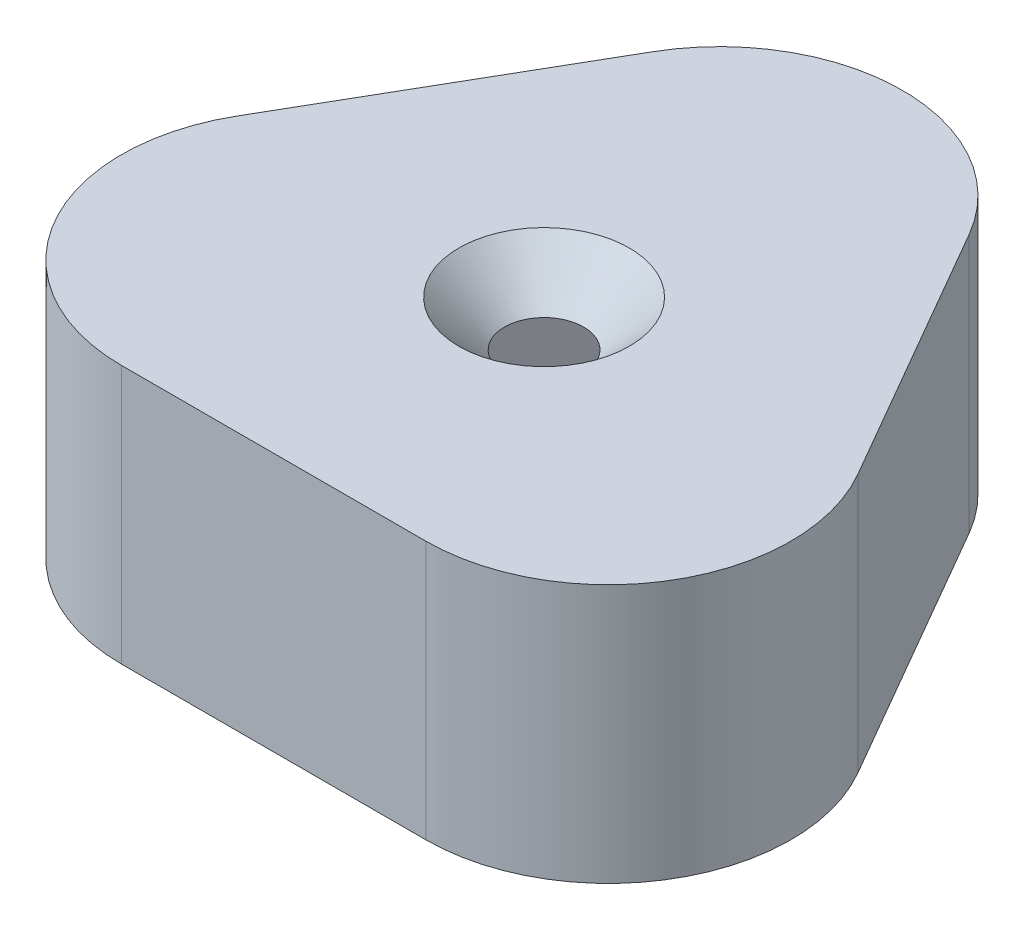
ISO-10303-21;
HEADER;
FILE_DESCRIPTION(('STEP AP214'),'2;1');
FILE_NAME('part.step','',(''),(''),'','','');
FILE_SCHEMA(('AUTOMOTIVE_DESIGN { 1 0 10303 214 1 1 1 1 }'));
ENDSEC;
DATA;
#1=APPLICATION_CONTEXT('core data for automotive mechanical design processes');
#2=APPLICATION_PROTOCOL_DEFINITION('international standard','automotive_design',2000,#1);
#3=PRODUCT_CONTEXT('',#1,'mechanical');
#4=PRODUCT('Part','Part','',(#3));
#5=PRODUCT_RELATED_PRODUCT_CATEGORY('part','',(#4));
#6=PRODUCT_DEFINITION_FORMATION('','',#4);
#7=PRODUCT_DEFINITION_CONTEXT('part definition',#1,'design');
#8=PRODUCT_DEFINITION('design','',#6,#7);
#9=PRODUCT_DEFINITION_SHAPE('','',#8);
#10=(LENGTH_UNIT() NAMED_UNIT(*) SI_UNIT(.MILLI.,.METRE.));
#11=(NAMED_UNIT(*) PLANE_ANGLE_UNIT() SI_UNIT($,.RADIAN.));
#12=(NAMED_UNIT(*) SI_UNIT($,.STERADIAN.) SOLID_ANGLE_UNIT());
#13=UNCERTAINTY_MEASURE_WITH_UNIT(LENGTH_MEASURE(1.E-05),#10,'distance_accuracy_value','');
#14=(GEOMETRIC_REPRESENTATION_CONTEXT(3) GLOBAL_UNCERTAINTY_ASSIGNED_CONTEXT((#13)) GLOBAL_UNIT_ASSIGNED_CONTEXT((#10,
#11,#12)) REPRESENTATION_CONTEXT('',''));
#15=CARTESIAN_POINT('',(0.,0.,0.));
#16=DIRECTION('',(0.,0.,1.));
#17=DIRECTION('',(1.,0.,0.));
#18=AXIS2_PLACEMENT_3D('',#15,#16,#17);
#19=CARTESIAN_POINT('',(0.,17.,-11.5470053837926));
#20=DIRECTION('',(0.,-1.,0.));
#21=DIRECTION('',(0.,0.,-1.));
#22=AXIS2_PLACEMENT_3D('',#19,#20,#21);
#23=CYLINDRICAL_SURFACE('',#22,12.);
#24=CARTESIAN_POINT('',(0.,0.,-11.5470053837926));
#25=DIRECTION('',(0.,1.,0.));
#26=DIRECTION('',(0.,0.,-1.));
#27=AXIS2_PLACEMENT_3D('',#24,#25,#26);
#28=CIRCLE('',#27,12.);
#29=CARTESIAN_POINT('',(10.3923048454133,0.,-17.5470053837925));
#30=VERTEX_POINT('',#29);
#31=CARTESIAN_POINT('',(-10.3923048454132,0.,-17.5470053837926));
#32=VERTEX_POINT('',#31);
#33=EDGE_CURVE('E255',#30,#32,#28,.T.);
#34=ORIENTED_EDGE('',*,*,#33,.T.);
#35=DIRECTION('',(0.,-1.,0.));
#36=VECTOR('',#35,1.);
#37=CARTESIAN_POINT('',(-10.3923048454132,17.,-17.5470053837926));
#38=LINE('',#37,#36);
#39=CARTESIAN_POINT('',(-10.3923048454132,17.,-17.5470053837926));
#40=VERTEX_POINT('',#39);
#41=EDGE_CURVE('E296',#40,#32,#38,.T.);
#42=ORIENTED_EDGE('',*,*,#41,.F.);
#43=CARTESIAN_POINT('',(0.,17.,-11.5470053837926));
#44=DIRECTION('',(0.,1.,0.));
#45=DIRECTION('',(0.,0.,-1.));
#46=AXIS2_PLACEMENT_3D('',#43,#44,#45);
#47=CIRCLE('',#46,12.);
#48=CARTESIAN_POINT('',(10.3923048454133,17.,-17.5470053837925));
#49=VERTEX_POINT('',#48);
#50=EDGE_CURVE('E256',#49,#40,#47,.T.);
#51=ORIENTED_EDGE('',*,*,#50,.F.);
#52=DIRECTION('',(0.,-1.,0.));
#53=VECTOR('',#52,1.);
#54=CARTESIAN_POINT('',(10.3923048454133,17.,-17.5470053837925));
#55=LINE('',#54,#53);
#56=EDGE_CURVE('E270',#49,#30,#55,.T.);
#57=ORIENTED_EDGE('',*,*,#56,.T.);
#58=EDGE_LOOP('',(#34,#42,#51,#57));
#59=FACE_BOUND('',#58,.T.);
#60=ADVANCED_FACE('F37',(#59),#23,.T.);
#61=CARTESIAN_POINT('',(-10.3923048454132,17.,-17.5470053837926));
#62=DIRECTION('',(0.866025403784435,0.,0.500000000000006));
#63=DIRECTION('',(0.500000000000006,0.,-0.866025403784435));
#64=AXIS2_PLACEMENT_3D('',#61,#62,#63);
#65=PLANE('',#64);
#66=DIRECTION('',(-0.500000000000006,0.,0.866025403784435));
#67=VECTOR('',#66,1.);
#68=CARTESIAN_POINT('',(-10.3923048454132,0.,-17.5470053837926));
#69=LINE('',#68,#67);
#70=CARTESIAN_POINT('',(-20.3923048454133,0.,-0.226497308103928));
#71=VERTEX_POINT('',#70);
#72=EDGE_CURVE('E273',#32,#71,#69,.T.);
#73=ORIENTED_EDGE('',*,*,#72,.T.);
#74=DIRECTION('',(0.,-1.,0.));
#75=VECTOR('',#74,1.);
#76=CARTESIAN_POINT('',(-20.3923048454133,17.,-0.226497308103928));
#77=LINE('',#76,#75);
#78=CARTESIAN_POINT('',(-20.3923048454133,17.,-0.226497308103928));
#79=VERTEX_POINT('',#78);
#80=EDGE_CURVE('E293',#79,#71,#77,.T.);
#81=ORIENTED_EDGE('',*,*,#80,.F.);
#82=DIRECTION('',(-0.500000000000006,0.,0.866025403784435));
#83=VECTOR('',#82,1.);
#84=CARTESIAN_POINT('',(-10.3923048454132,17.,-17.5470053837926));
#85=LINE('',#84,#83);
#86=EDGE_CURVE('E259',#40,#79,#85,.T.);
#87=ORIENTED_EDGE('',*,*,#86,.F.);
#88=ORIENTED_EDGE('',*,*,#41,.T.);
#89=EDGE_LOOP('',(#73,#81,#87,#88));
#90=FACE_BOUND('',#89,.T.);
#91=ADVANCED_FACE('F317',(#90),#65,.F.);
#92=CARTESIAN_POINT('',(-10.0000000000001,17.,5.77350269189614));
#93=DIRECTION('',(0.,-1.,0.));
#94=DIRECTION('',(0.,0.,-1.));
#95=AXIS2_PLACEMENT_3D('',#92,#93,#94);
#96=CYLINDRICAL_SURFACE('',#95,12.);
#97=CARTESIAN_POINT('',(-10.0000000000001,0.,5.77350269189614));
#98=DIRECTION('',(0.,1.,0.));
#99=DIRECTION('',(0.,0.,1.));
#100=AXIS2_PLACEMENT_3D('',#97,#98,#99);
#101=CIRCLE('',#100,12.);
#102=CARTESIAN_POINT('',(-10.0000000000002,0.,17.7735026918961));
#103=VERTEX_POINT('',#102);
#104=EDGE_CURVE('E275',#71,#103,#101,.T.);
#105=ORIENTED_EDGE('',*,*,#104,.T.);
#106=DIRECTION('',(0.,-1.,0.));
#107=VECTOR('',#106,1.);
#108=CARTESIAN_POINT('',(-10.0000000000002,17.,17.7735026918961));
#109=LINE('',#108,#107);
#110=CARTESIAN_POINT('',(-10.0000000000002,17.,17.7735026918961));
#111=VERTEX_POINT('',#110);
#112=EDGE_CURVE('E290',#111,#103,#109,.T.);
#113=ORIENTED_EDGE('',*,*,#112,.F.);
#114=CARTESIAN_POINT('',(-10.0000000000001,17.,5.77350269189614));
#115=DIRECTION('',(0.,1.,0.));
#116=DIRECTION('',(0.,0.,1.));
#117=AXIS2_PLACEMENT_3D('',#114,#115,#116);
#118=CIRCLE('',#117,12.);
#119=EDGE_CURVE('E262',#79,#111,#118,.T.);
#120=ORIENTED_EDGE('',*,*,#119,.F.);
#121=ORIENTED_EDGE('',*,*,#80,.T.);
#122=EDGE_LOOP('',(#105,#113,#120,#121));
#123=FACE_BOUND('',#122,.T.);
#124=ADVANCED_FACE('F322',(#123),#96,.T.);
#125=CARTESIAN_POINT('',(9.9999999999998,17.,17.7735026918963));
#126=DIRECTION('',(0.,0.,-1.));
#127=DIRECTION('',(-1.,0.,0.));
#128=AXIS2_PLACEMENT_3D('',#125,#126,#127);
#129=PLANE('',#128);
#130=DIRECTION('',(1.,0.,0.));
#131=VECTOR('',#130,1.);
#132=CARTESIAN_POINT('',(9.9999999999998,0.,17.7735026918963));
#133=LINE('',#132,#131);
#134=CARTESIAN_POINT('',(9.9999999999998,0.,17.7735026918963));
#135=VERTEX_POINT('',#134);
#136=EDGE_CURVE('E277',#103,#135,#133,.T.);
#137=ORIENTED_EDGE('',*,*,#136,.T.);
#138=DIRECTION('',(0.,-1.,0.));
#139=VECTOR('',#138,1.);
#140=CARTESIAN_POINT('',(9.9999999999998,17.,17.7735026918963));
#141=LINE('',#140,#139);
#142=CARTESIAN_POINT('',(9.9999999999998,17.,17.7735026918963));
#143=VERTEX_POINT('',#142);
#144=EDGE_CURVE('E287',#143,#135,#141,.T.);
#145=ORIENTED_EDGE('',*,*,#144,.F.);
#146=DIRECTION('',(1.,0.,0.));
#147=VECTOR('',#146,1.);
#148=CARTESIAN_POINT('',(9.9999999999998,17.,17.7735026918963));
#149=LINE('',#148,#147);
#150=EDGE_CURVE('E264',#111,#143,#149,.T.);
#151=ORIENTED_EDGE('',*,*,#150,.F.);
#152=ORIENTED_EDGE('',*,*,#112,.T.);
#153=EDGE_LOOP('',(#137,#145,#151,#152));
#154=FACE_BOUND('',#153,.T.);
#155=ADVANCED_FACE('F328',(#154),#129,.F.);
#156=CARTESIAN_POINT('',(9.99999999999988,17.,5.77350269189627));
#157=DIRECTION('',(0.,-1.,0.));
#158=DIRECTION('',(0.,0.,-1.));
#159=AXIS2_PLACEMENT_3D('',#156,#157,#158);
#160=CYLINDRICAL_SURFACE('',#159,12.);
#161=CARTESIAN_POINT('',(9.99999999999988,0.,5.77350269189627));
#162=DIRECTION('',(0.,1.,0.));
#163=DIRECTION('',(0.,0.,-1.));
#164=AXIS2_PLACEMENT_3D('',#161,#162,#163);
#165=CIRCLE('',#164,12.);
#166=CARTESIAN_POINT('',(20.3923048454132,0.,-0.226497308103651));
#167=VERTEX_POINT('',#166);
#168=EDGE_CURVE('E279',#135,#167,#165,.T.);
#169=ORIENTED_EDGE('',*,*,#168,.T.);
#170=DIRECTION('',(0.,-1.,0.));
#171=VECTOR('',#170,1.);
#172=CARTESIAN_POINT('',(20.3923048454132,17.,-0.226497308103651));
#173=LINE('',#172,#171);
#174=CARTESIAN_POINT('',(20.3923048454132,17.,-0.226497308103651));
#175=VERTEX_POINT('',#174);
#176=EDGE_CURVE('E284',#175,#167,#173,.T.);
#177=ORIENTED_EDGE('',*,*,#176,.F.);
#178=CARTESIAN_POINT('',(9.99999999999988,17.,5.77350269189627));
#179=DIRECTION('',(0.,1.,0.));
#180=DIRECTION('',(0.,0.,-1.));
#181=AXIS2_PLACEMENT_3D('',#178,#179,#180);
#182=CIRCLE('',#181,12.);
#183=EDGE_CURVE('E266',#143,#175,#182,.T.);
#184=ORIENTED_EDGE('',*,*,#183,.F.);
#185=ORIENTED_EDGE('',*,*,#144,.T.);
#186=EDGE_LOOP('',(#169,#177,#184,#185));
#187=FACE_BOUND('',#186,.T.);
#188=ADVANCED_FACE('F332',(#187),#160,.T.);
#189=CARTESIAN_POINT('',(10.3923048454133,17.,-17.5470053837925));
#190=DIRECTION('',(-0.866025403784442,0.,0.499999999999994));
#191=DIRECTION('',(0.499999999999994,0.,0.866025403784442));
#192=AXIS2_PLACEMENT_3D('',#189,#190,#191);
#193=PLANE('',#192);
#194=DIRECTION('',(-0.499999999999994,0.,-0.866025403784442));
#195=VECTOR('',#194,1.);
#196=CARTESIAN_POINT('',(10.3923048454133,0.,-17.5470053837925));
#197=LINE('',#196,#195);
#198=EDGE_CURVE('E260',#167,#30,#197,.T.);
#199=ORIENTED_EDGE('',*,*,#198,.T.);
#200=ORIENTED_EDGE('',*,*,#56,.F.);
#201=DIRECTION('',(-0.499999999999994,0.,-0.866025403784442));
#202=VECTOR('',#201,1.);
#203=CARTESIAN_POINT('',(10.3923048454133,17.,-17.5470053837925));
#204=LINE('',#203,#202);
#205=EDGE_CURVE('E268',#175,#49,#204,.T.);
#206=ORIENTED_EDGE('',*,*,#205,.F.);
#207=ORIENTED_EDGE('',*,*,#176,.T.);
#208=EDGE_LOOP('',(#199,#200,#206,#207));
#209=FACE_BOUND('',#208,.T.);
#210=ADVANCED_FACE('F336',(#209),#193,.F.);
#211=CARTESIAN_POINT('',(0.,17.,-11.5470053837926));
#212=DIRECTION('',(0.,-1.,0.));
#213=DIRECTION('',(0.,0.,-1.));
#214=AXIS2_PLACEMENT_3D('',#211,#212,#213);
#215=PLANE('',#214);
#216=CARTESIAN_POINT('',(0.,17.,0.));
#217=DIRECTION('',(0.,-1.,0.));
#218=DIRECTION('',(0.,0.,-1.));
#219=AXIS2_PLACEMENT_3D('',#216,#217,#218);
#220=CIRCLE('',#219,5.60000000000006);
#221=CARTESIAN_POINT('',(0.,17.,5.60000000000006));
#222=VERTEX_POINT('',#221);
#223=EDGE_CURVE('E45',#222,#222,#220,.T.);
#224=ORIENTED_EDGE('',*,*,#223,.T.);
#225=EDGE_LOOP('',(#224));
#226=FACE_BOUND('',#225,.T.);
#227=ORIENTED_EDGE('',*,*,#50,.T.);
#228=ORIENTED_EDGE('',*,*,#86,.T.);
#229=ORIENTED_EDGE('',*,*,#119,.T.);
#230=ORIENTED_EDGE('',*,*,#150,.T.);
#231=ORIENTED_EDGE('',*,*,#183,.T.);
#232=ORIENTED_EDGE('',*,*,#205,.T.);
#233=EDGE_LOOP('',(#227,#228,#229,#230,#231,#232));
#234=FACE_BOUND('',#233,.T.);
#235=ADVANCED_FACE('F303',(#226,#234),#215,.F.);
#236=CARTESIAN_POINT('',(0.,0.,-11.5470053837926));
#237=DIRECTION('',(0.,-1.,0.));
#238=DIRECTION('',(0.,0.,-1.));
#239=AXIS2_PLACEMENT_3D('',#236,#237,#238);
#240=PLANE('',#239);
#241=CARTESIAN_POINT('',(0.,0.,-11.5470053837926));
#242=DIRECTION('',(0.,-1.,0.));
#243=DIRECTION('',(0.,0.,-1.));
#244=AXIS2_PLACEMENT_3D('',#241,#242,#243);
#245=CIRCLE('',#244,10.75);
#246=CARTESIAN_POINT('',(-9.30977309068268,0.,-16.9220053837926));
#247=VERTEX_POINT('',#246);
#248=CARTESIAN_POINT('',(9.30977309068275,0.,-16.9220053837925));
#249=VERTEX_POINT('',#248);
#250=EDGE_CURVE('E52',#247,#249,#245,.T.);
#251=ORIENTED_EDGE('',*,*,#250,.F.);
#252=DIRECTION('',(0.500000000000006,0.,-0.866025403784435));
#253=VECTOR('',#252,1.);
#254=CARTESIAN_POINT('',(-19.3097730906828,0.,0.398502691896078));
#255=LINE('',#254,#253);
#256=CARTESIAN_POINT('',(-19.3097730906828,0.,0.398502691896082));
#257=VERTEX_POINT('',#256);
#258=EDGE_CURVE('E183',#257,#247,#255,.T.);
#259=ORIENTED_EDGE('',*,*,#258,.F.);
#260=CARTESIAN_POINT('',(-10.0000000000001,0.,5.77350269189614));
#261=DIRECTION('',(0.,-1.,0.));
#262=DIRECTION('',(0.,0.,-1.));
#263=AXIS2_PLACEMENT_3D('',#260,#261,#262);
#264=CIRCLE('',#263,10.75);
#265=CARTESIAN_POINT('',(-10.0000000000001,0.,16.5235026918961));
#266=VERTEX_POINT('',#265);
#267=EDGE_CURVE('E186',#266,#257,#264,.T.);
#268=ORIENTED_EDGE('',*,*,#267,.F.);
#269=DIRECTION('',(-1.,0.,0.));
#270=VECTOR('',#269,1.);
#271=CARTESIAN_POINT('',(9.99999999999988,0.,16.5235026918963));
#272=LINE('',#271,#270);
#273=CARTESIAN_POINT('',(9.99999999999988,0.,16.5235026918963));
#274=VERTEX_POINT('',#273);
#275=EDGE_CURVE('E202',#274,#266,#272,.T.);
#276=ORIENTED_EDGE('',*,*,#275,.F.);
#277=CARTESIAN_POINT('',(9.99999999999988,0.,5.77350269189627));
#278=DIRECTION('',(0.,-1.,0.));
#279=DIRECTION('',(0.,0.,-1.));
#280=AXIS2_PLACEMENT_3D('',#277,#278,#279);
#281=CIRCLE('',#280,10.75);
#282=CARTESIAN_POINT('',(19.3097730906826,0.,0.398502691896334));
#283=VERTEX_POINT('',#282);
#284=EDGE_CURVE('E199',#283,#274,#281,.T.);
#285=ORIENTED_EDGE('',*,*,#284,.F.);
#286=DIRECTION('',(0.499999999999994,0.,0.866025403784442));
#287=VECTOR('',#286,1.);
#288=CARTESIAN_POINT('',(9.30977309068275,0.,-16.9220053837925));
#289=LINE('',#288,#287);
#290=EDGE_CURVE('E197',#249,#283,#289,.T.);
#291=ORIENTED_EDGE('',*,*,#290,.F.);
#292=EDGE_LOOP('',(#251,#259,#268,#276,#285,#291));
#293=FACE_BOUND('',#292,.T.);
#294=ORIENTED_EDGE('',*,*,#33,.F.);
#295=ORIENTED_EDGE('',*,*,#198,.F.);
#296=ORIENTED_EDGE('',*,*,#168,.F.);
#297=ORIENTED_EDGE('',*,*,#136,.F.);
#298=ORIENTED_EDGE('',*,*,#104,.F.);
#299=ORIENTED_EDGE('',*,*,#72,.F.);
#300=EDGE_LOOP('',(#294,#295,#296,#297,#298,#299));
#301=FACE_BOUND('',#300,.T.);
#302=ADVANCED_FACE('F341',(#293,#301),#240,.T.);
#303=CARTESIAN_POINT('',(0.,1.25,-11.5470053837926));
#304=DIRECTION('',(0.,-1.,0.));
#305=DIRECTION('',(0.,0.,-1.));
#306=AXIS2_PLACEMENT_3D('',#303,#304,#305);
#307=PLANE('',#306);
#308=CARTESIAN_POINT('',(0.,1.25,-11.5470053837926));
#309=DIRECTION('',(0.,-1.,0.));
#310=DIRECTION('',(0.,0.,-1.));
#311=AXIS2_PLACEMENT_3D('',#308,#309,#310);
#312=CIRCLE('',#311,10.75);
#313=CARTESIAN_POINT('',(-9.30977309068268,1.25,-16.9220053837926));
#314=VERTEX_POINT('',#313);
#315=CARTESIAN_POINT('',(9.30977309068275,1.25,-16.9220053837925));
#316=VERTEX_POINT('',#315);
#317=EDGE_CURVE('E164',#314,#316,#312,.T.);
#318=ORIENTED_EDGE('',*,*,#317,.T.);
#319=DIRECTION('',(0.499999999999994,0.,0.866025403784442));
#320=VECTOR('',#319,1.);
#321=CARTESIAN_POINT('',(9.30977309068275,1.25,-16.9220053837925));
#322=LINE('',#321,#320);
#323=CARTESIAN_POINT('',(19.3097730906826,1.25,0.398502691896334));
#324=VERTEX_POINT('',#323);
#325=EDGE_CURVE('E173',#316,#324,#322,.T.);
#326=ORIENTED_EDGE('',*,*,#325,.T.);
#327=CARTESIAN_POINT('',(9.99999999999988,1.25,5.77350269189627));
#328=DIRECTION('',(0.,-1.,0.));
#329=DIRECTION('',(0.,0.,-1.));
#330=AXIS2_PLACEMENT_3D('',#327,#328,#329);
#331=CIRCLE('',#330,10.75);
#332=CARTESIAN_POINT('',(9.99999999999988,1.25,16.5235026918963));
#333=VERTEX_POINT('',#332);
#334=EDGE_CURVE('E178',#324,#333,#331,.T.);
#335=ORIENTED_EDGE('',*,*,#334,.T.);
#336=DIRECTION('',(-1.,0.,0.));
#337=VECTOR('',#336,1.);
#338=CARTESIAN_POINT('',(9.99999999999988,1.25,16.5235026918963));
#339=LINE('',#338,#337);
#340=CARTESIAN_POINT('',(-10.0000000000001,1.25,16.5235026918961));
#341=VERTEX_POINT('',#340);
#342=EDGE_CURVE('E190',#333,#341,#339,.T.);
#343=ORIENTED_EDGE('',*,*,#342,.T.);
#344=CARTESIAN_POINT('',(-10.0000000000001,1.25,5.77350269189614));
#345=DIRECTION('',(0.,-1.,0.));
#346=DIRECTION('',(0.,0.,-1.));
#347=AXIS2_PLACEMENT_3D('',#344,#345,#346);
#348=CIRCLE('',#347,10.75);
#349=CARTESIAN_POINT('',(-19.3097730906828,1.25,0.398502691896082));
#350=VERTEX_POINT('',#349);
#351=EDGE_CURVE('E193',#341,#350,#348,.T.);
#352=ORIENTED_EDGE('',*,*,#351,.T.);
#353=DIRECTION('',(0.500000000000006,0.,-0.866025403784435));
#354=VECTOR('',#353,1.);
#355=CARTESIAN_POINT('',(-19.3097730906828,1.25,0.398502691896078));
#356=LINE('',#355,#354);
#357=EDGE_CURVE('E170',#350,#314,#356,.T.);
#358=ORIENTED_EDGE('',*,*,#357,.T.);
#359=EDGE_LOOP('',(#318,#326,#335,#343,#352,#358));
#360=FACE_BOUND('',#359,.T.);
#361=CARTESIAN_POINT('',(-10.0000000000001,1.25,5.77350269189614));
#362=DIRECTION('',(0.,-1.,0.));
#363=DIRECTION('',(0.,0.,-1.));
#364=AXIS2_PLACEMENT_3D('',#361,#362,#363);
#365=CIRCLE('',#364,9.5);
#366=CARTESIAN_POINT('',(-18.2272413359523,1.25,1.02350269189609));
#367=VERTEX_POINT('',#366);
#368=CARTESIAN_POINT('',(-10.0000000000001,1.25,15.2735026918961));
#369=VERTEX_POINT('',#368);
#370=EDGE_CURVE('E223',#367,#369,#365,.F.);
#371=ORIENTED_EDGE('',*,*,#370,.T.);
#372=DIRECTION('',(1.,0.,0.));
#373=VECTOR('',#372,1.);
#374=CARTESIAN_POINT('',(-10.0000000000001,1.25,15.2735026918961));
#375=LINE('',#374,#373);
#376=CARTESIAN_POINT('',(9.99999999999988,1.25,15.2735026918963));
#377=VERTEX_POINT('',#376);
#378=EDGE_CURVE('E221',#369,#377,#375,.T.);
#379=ORIENTED_EDGE('',*,*,#378,.T.);
#380=CARTESIAN_POINT('',(9.99999999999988,1.25,5.77350269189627));
#381=DIRECTION('',(0.,-1.,0.));
#382=DIRECTION('',(0.,0.,-1.));
#383=AXIS2_PLACEMENT_3D('',#380,#381,#382);
#384=CIRCLE('',#383,9.5);
#385=CARTESIAN_POINT('',(18.2272413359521,1.25,1.02350269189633));
#386=VERTEX_POINT('',#385);
#387=EDGE_CURVE('E219',#377,#386,#384,.F.);
#388=ORIENTED_EDGE('',*,*,#387,.T.);
#389=DIRECTION('',(-0.499999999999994,0.,-0.866025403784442));
#390=VECTOR('',#389,1.);
#391=CARTESIAN_POINT('',(18.2272413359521,1.25,1.02350269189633));
#392=LINE('',#391,#390);
#393=CARTESIAN_POINT('',(8.2272413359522,1.25,-16.2970053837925));
#394=VERTEX_POINT('',#393);
#395=EDGE_CURVE('E217',#386,#394,#392,.T.);
#396=ORIENTED_EDGE('',*,*,#395,.T.);
#397=CARTESIAN_POINT('',(0.,1.25,-11.5470053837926));
#398=DIRECTION('',(0.,-1.,0.));
#399=DIRECTION('',(0.,0.,-1.));
#400=AXIS2_PLACEMENT_3D('',#397,#398,#399);
#401=CIRCLE('',#400,9.5);
#402=CARTESIAN_POINT('',(-8.22724133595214,1.25,-16.2970053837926));
#403=VERTEX_POINT('',#402);
#404=EDGE_CURVE('E60',#394,#403,#401,.F.);
#405=ORIENTED_EDGE('',*,*,#404,.T.);
#406=DIRECTION('',(-0.500000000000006,0.,0.866025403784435));
#407=VECTOR('',#406,1.);
#408=CARTESIAN_POINT('',(-18.2272413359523,1.25,1.02350269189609));
#409=LINE('',#408,#407);
#410=EDGE_CURVE('E299',#403,#367,#409,.T.);
#411=ORIENTED_EDGE('',*,*,#410,.T.);
#412=EDGE_LOOP('',(#371,#379,#388,#396,#405,#411));
#413=FACE_BOUND('',#412,.T.);
#414=ADVANCED_FACE('F180',(#360,#413),#307,.T.);
#415=CARTESIAN_POINT('',(0.,1.25,-11.5470053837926));
#416=DIRECTION('',(0.,-1.,0.));
#417=DIRECTION('',(0.,0.,-1.));
#418=AXIS2_PLACEMENT_3D('',#415,#416,#417);
#419=CYLINDRICAL_SURFACE('',#418,10.75);
#420=ORIENTED_EDGE('',*,*,#250,.T.);
#421=DIRECTION('',(0.,-1.,0.));
#422=VECTOR('',#421,1.);
#423=CARTESIAN_POINT('',(9.30977309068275,1.25,-16.9220053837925));
#424=LINE('',#423,#422);
#425=EDGE_CURVE('E160',#316,#249,#424,.T.);
#426=ORIENTED_EDGE('',*,*,#425,.F.);
#427=ORIENTED_EDGE('',*,*,#317,.F.);
#428=DIRECTION('',(0.,-1.,0.));
#429=VECTOR('',#428,1.);
#430=CARTESIAN_POINT('',(-9.30977309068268,1.25,-16.9220053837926));
#431=LINE('',#430,#429);
#432=EDGE_CURVE('E207',#314,#247,#431,.T.);
#433=ORIENTED_EDGE('',*,*,#432,.T.);
#434=EDGE_LOOP('',(#420,#426,#427,#433));
#435=FACE_BOUND('',#434,.T.);
#436=ADVANCED_FACE('F162',(#435),#419,.F.);
#437=CARTESIAN_POINT('',(-19.3097730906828,1.25,0.398502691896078));
#438=DIRECTION('',(-0.866025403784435,0.,-0.500000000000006));
#439=DIRECTION('',(-0.500000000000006,0.,0.866025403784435));
#440=AXIS2_PLACEMENT_3D('',#437,#438,#439);
#441=PLANE('',#440);
#442=ORIENTED_EDGE('',*,*,#258,.T.);
#443=ORIENTED_EDGE('',*,*,#432,.F.);
#444=ORIENTED_EDGE('',*,*,#357,.F.);
#445=DIRECTION('',(0.,-1.,0.));
#446=VECTOR('',#445,1.);
#447=CARTESIAN_POINT('',(-19.3097730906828,1.25,0.398502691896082));
#448=LINE('',#447,#446);
#449=EDGE_CURVE('E209',#350,#257,#448,.T.);
#450=ORIENTED_EDGE('',*,*,#449,.T.);
#451=EDGE_LOOP('',(#442,#443,#444,#450));
#452=FACE_BOUND('',#451,.T.);
#453=ADVANCED_FACE('F372',(#452),#441,.F.);
#454=CARTESIAN_POINT('',(-10.0000000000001,1.25,5.77350269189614));
#455=DIRECTION('',(0.,-1.,0.));
#456=DIRECTION('',(0.,0.,-1.));
#457=AXIS2_PLACEMENT_3D('',#454,#455,#456);
#458=CYLINDRICAL_SURFACE('',#457,10.75);
#459=ORIENTED_EDGE('',*,*,#267,.T.);
#460=ORIENTED_EDGE('',*,*,#449,.F.);
#461=ORIENTED_EDGE('',*,*,#351,.F.);
#462=DIRECTION('',(0.,-1.,0.));
#463=VECTOR('',#462,1.);
#464=CARTESIAN_POINT('',(-10.0000000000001,1.25,16.5235026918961));
#465=LINE('',#464,#463);
#466=EDGE_CURVE('E211',#341,#266,#465,.T.);
#467=ORIENTED_EDGE('',*,*,#466,.T.);
#468=EDGE_LOOP('',(#459,#460,#461,#467));
#469=FACE_BOUND('',#468,.T.);
#470=ADVANCED_FACE('F382',(#469),#458,.F.);
#471=CARTESIAN_POINT('',(9.99999999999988,1.25,16.5235026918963));
#472=DIRECTION('',(0.,0.,1.));
#473=DIRECTION('',(1.,0.,0.));
#474=AXIS2_PLACEMENT_3D('',#471,#472,#473);
#475=PLANE('',#474);
#476=ORIENTED_EDGE('',*,*,#275,.T.);
#477=ORIENTED_EDGE('',*,*,#466,.F.);
#478=ORIENTED_EDGE('',*,*,#342,.F.);
#479=DIRECTION('',(0.,-1.,0.));
#480=VECTOR('',#479,1.);
#481=CARTESIAN_POINT('',(9.99999999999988,1.25,16.5235026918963));
#482=LINE('',#481,#480);
#483=EDGE_CURVE('E213',#333,#274,#482,.T.);
#484=ORIENTED_EDGE('',*,*,#483,.T.);
#485=EDGE_LOOP('',(#476,#477,#478,#484));
#486=FACE_BOUND('',#485,.T.);
#487=ADVANCED_FACE('F378',(#486),#475,.F.);
#488=CARTESIAN_POINT('',(9.99999999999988,1.25,5.77350269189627));
#489=DIRECTION('',(0.,-1.,0.));
#490=DIRECTION('',(0.,0.,-1.));
#491=AXIS2_PLACEMENT_3D('',#488,#489,#490);
#492=CYLINDRICAL_SURFACE('',#491,10.75);
#493=ORIENTED_EDGE('',*,*,#284,.T.);
#494=ORIENTED_EDGE('',*,*,#483,.F.);
#495=ORIENTED_EDGE('',*,*,#334,.F.);
#496=DIRECTION('',(0.,-1.,0.));
#497=VECTOR('',#496,1.);
#498=CARTESIAN_POINT('',(19.3097730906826,1.25,0.398502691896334));
#499=LINE('',#498,#497);
#500=EDGE_CURVE('E169',#324,#283,#499,.T.);
#501=ORIENTED_EDGE('',*,*,#500,.T.);
#502=EDGE_LOOP('',(#493,#494,#495,#501));
#503=FACE_BOUND('',#502,.T.);
#504=ADVANCED_FACE('F375',(#503),#492,.F.);
#505=CARTESIAN_POINT('',(9.30977309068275,1.25,-16.9220053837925));
#506=DIRECTION('',(0.866025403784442,0.,-0.499999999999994));
#507=DIRECTION('',(-0.499999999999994,0.,-0.866025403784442));
#508=AXIS2_PLACEMENT_3D('',#505,#506,#507);
#509=PLANE('',#508);
#510=ORIENTED_EDGE('',*,*,#290,.T.);
#511=ORIENTED_EDGE('',*,*,#500,.F.);
#512=ORIENTED_EDGE('',*,*,#325,.F.);
#513=ORIENTED_EDGE('',*,*,#425,.T.);
#514=EDGE_LOOP('',(#510,#511,#512,#513));
#515=FACE_BOUND('',#514,.T.);
#516=ADVANCED_FACE('F174',(#515),#509,.F.);
#517=CARTESIAN_POINT('',(0.,14.,-11.5470053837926));
#518=DIRECTION('',(0.,-1.,0.));
#519=DIRECTION('',(0.,0.,-1.));
#520=AXIS2_PLACEMENT_3D('',#517,#518,#519);
#521=PLANE('',#520);
#522=CARTESIAN_POINT('',(0.,14.,0.));
#523=DIRECTION('',(0.,-1.,0.));
#524=DIRECTION('',(0.,0.,-1.));
#525=AXIS2_PLACEMENT_3D('',#522,#523,#524);
#526=CIRCLE('',#525,2.60000000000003);
#527=CARTESIAN_POINT('',(0.,14.,2.60000000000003));
#528=VERTEX_POINT('',#527);
#529=EDGE_CURVE('E12',#528,#528,#526,.F.);
#530=ORIENTED_EDGE('',*,*,#529,.T.);
#531=EDGE_LOOP('',(#530));
#532=FACE_BOUND('',#531,.T.);
#533=CARTESIAN_POINT('',(-10.0000000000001,14.,5.77350269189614));
#534=DIRECTION('',(0.,-1.,0.));
#535=DIRECTION('',(0.,0.,-1.));
#536=AXIS2_PLACEMENT_3D('',#533,#534,#535);
#537=CIRCLE('',#536,9.5);
#538=CARTESIAN_POINT('',(-18.2272413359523,14.,1.02350269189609));
#539=VERTEX_POINT('',#538);
#540=CARTESIAN_POINT('',(-10.0000000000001,14.,15.2735026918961));
#541=VERTEX_POINT('',#540);
#542=EDGE_CURVE('E235',#539,#541,#537,.F.);
#543=ORIENTED_EDGE('',*,*,#542,.F.);
#544=DIRECTION('',(-0.500000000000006,0.,0.866025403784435));
#545=VECTOR('',#544,1.);
#546=CARTESIAN_POINT('',(-18.2272413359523,14.,1.02350269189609));
#547=LINE('',#546,#545);
#548=CARTESIAN_POINT('',(-8.22724133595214,14.,-16.2970053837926));
#549=VERTEX_POINT('',#548);
#550=EDGE_CURVE('E237',#549,#539,#547,.T.);
#551=ORIENTED_EDGE('',*,*,#550,.F.);
#552=CARTESIAN_POINT('',(0.,14.,-11.5470053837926));
#553=DIRECTION('',(0.,-1.,0.));
#554=DIRECTION('',(0.,0.,-1.));
#555=AXIS2_PLACEMENT_3D('',#552,#553,#554);
#556=CIRCLE('',#555,9.5);
#557=CARTESIAN_POINT('',(8.2272413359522,14.,-16.2970053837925));
#558=VERTEX_POINT('',#557);
#559=EDGE_CURVE('E226',#558,#549,#556,.F.);
#560=ORIENTED_EDGE('',*,*,#559,.F.);
#561=DIRECTION('',(-0.499999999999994,0.,-0.866025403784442));
#562=VECTOR('',#561,1.);
#563=CARTESIAN_POINT('',(18.2272413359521,14.,1.02350269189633));
#564=LINE('',#563,#562);
#565=CARTESIAN_POINT('',(18.2272413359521,14.,1.02350269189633));
#566=VERTEX_POINT('',#565);
#567=EDGE_CURVE('E228',#566,#558,#564,.T.);
#568=ORIENTED_EDGE('',*,*,#567,.F.);
#569=CARTESIAN_POINT('',(9.99999999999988,14.,5.77350269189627));
#570=DIRECTION('',(0.,-1.,0.));
#571=DIRECTION('',(0.,0.,-1.));
#572=AXIS2_PLACEMENT_3D('',#569,#570,#571);
#573=CIRCLE('',#572,9.5);
#574=CARTESIAN_POINT('',(9.99999999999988,14.,15.2735026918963));
#575=VERTEX_POINT('',#574);
#576=EDGE_CURVE('E231',#575,#566,#573,.F.);
#577=ORIENTED_EDGE('',*,*,#576,.F.);
#578=DIRECTION('',(1.,0.,0.));
#579=VECTOR('',#578,1.);
#580=CARTESIAN_POINT('',(-10.0000000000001,14.,15.2735026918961));
#581=LINE('',#580,#579);
#582=EDGE_CURVE('E233',#541,#575,#581,.T.);
#583=ORIENTED_EDGE('',*,*,#582,.F.);
#584=EDGE_LOOP('',(#543,#551,#560,#568,#577,#583));
#585=FACE_BOUND('',#584,.T.);
#586=ADVANCED_FACE('F351',(#532,#585),#521,.T.);
#587=CARTESIAN_POINT('',(-18.2272413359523,70.2933326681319,1.02350269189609));
#588=DIRECTION('',(-0.866025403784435,0.,-0.500000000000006));
#589=DIRECTION('',(-0.500000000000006,0.,0.866025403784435));
#590=AXIS2_PLACEMENT_3D('',#587,#588,#589);
#591=PLANE('',#590);
#592=ORIENTED_EDGE('',*,*,#410,.F.);
#593=DIRECTION('',(0.,-1.,0.));
#594=VECTOR('',#593,1.);
#595=CARTESIAN_POINT('',(-8.22724133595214,70.2933326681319,-16.2970053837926));
#596=LINE('',#595,#594);
#597=EDGE_CURVE('E249',#549,#403,#596,.T.);
#598=ORIENTED_EDGE('',*,*,#597,.F.);
#599=ORIENTED_EDGE('',*,*,#550,.T.);
#600=DIRECTION('',(0.,-1.,0.));
#601=VECTOR('',#600,1.);
#602=CARTESIAN_POINT('',(-18.2272413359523,70.2933326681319,1.02350269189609));
#603=LINE('',#602,#601);
#604=EDGE_CURVE('E225',#539,#367,#603,.T.);
#605=ORIENTED_EDGE('',*,*,#604,.T.);
#606=EDGE_LOOP('',(#592,#598,#599,#605));
#607=FACE_BOUND('',#606,.T.);
#608=ADVANCED_FACE('F347',(#607),#591,.F.);
#609=CARTESIAN_POINT('',(0.,70.2933326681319,-11.5470053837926));
#610=DIRECTION('',(0.,-1.,0.));
#611=DIRECTION('',(0.,0.,-1.));
#612=AXIS2_PLACEMENT_3D('',#609,#610,#611);
#613=CYLINDRICAL_SURFACE('',#612,9.5);
#614=ORIENTED_EDGE('',*,*,#404,.F.);
#615=DIRECTION('',(0.,-1.,0.));
#616=VECTOR('',#615,1.);
#617=CARTESIAN_POINT('',(8.2272413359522,70.2933326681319,-16.2970053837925));
#618=LINE('',#617,#616);
#619=EDGE_CURVE('E246',#558,#394,#618,.T.);
#620=ORIENTED_EDGE('',*,*,#619,.F.);
#621=ORIENTED_EDGE('',*,*,#559,.T.);
#622=ORIENTED_EDGE('',*,*,#597,.T.);
#623=EDGE_LOOP('',(#614,#620,#621,#622));
#624=FACE_BOUND('',#623,.T.);
#625=ADVANCED_FACE('F350',(#624),#613,.F.);
#626=CARTESIAN_POINT('',(18.2272413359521,70.2933326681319,1.02350269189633));
#627=DIRECTION('',(0.866025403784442,0.,-0.499999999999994));
#628=DIRECTION('',(-0.499999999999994,0.,-0.866025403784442));
#629=AXIS2_PLACEMENT_3D('',#626,#627,#628);
#630=PLANE('',#629);
#631=ORIENTED_EDGE('',*,*,#395,.F.);
#632=DIRECTION('',(0.,-1.,0.));
#633=VECTOR('',#632,1.);
#634=CARTESIAN_POINT('',(18.2272413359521,70.2933326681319,1.02350269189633));
#635=LINE('',#634,#633);
#636=EDGE_CURVE('E243',#566,#386,#635,.T.);
#637=ORIENTED_EDGE('',*,*,#636,.F.);
#638=ORIENTED_EDGE('',*,*,#567,.T.);
#639=ORIENTED_EDGE('',*,*,#619,.T.);
#640=EDGE_LOOP('',(#631,#637,#638,#639));
#641=FACE_BOUND('',#640,.T.);
#642=ADVANCED_FACE('F355',(#641),#630,.F.);
#643=CARTESIAN_POINT('',(9.99999999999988,70.2933326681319,5.77350269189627));
#644=DIRECTION('',(0.,-1.,0.));
#645=DIRECTION('',(0.,0.,-1.));
#646=AXIS2_PLACEMENT_3D('',#643,#644,#645);
#647=CYLINDRICAL_SURFACE('',#646,9.5);
#648=ORIENTED_EDGE('',*,*,#387,.F.);
#649=DIRECTION('',(0.,-1.,0.));
#650=VECTOR('',#649,1.);
#651=CARTESIAN_POINT('',(9.99999999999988,70.2933326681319,15.2735026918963));
#652=LINE('',#651,#650);
#653=EDGE_CURVE('E240',#575,#377,#652,.T.);
#654=ORIENTED_EDGE('',*,*,#653,.F.);
#655=ORIENTED_EDGE('',*,*,#576,.T.);
#656=ORIENTED_EDGE('',*,*,#636,.T.);
#657=EDGE_LOOP('',(#648,#654,#655,#656));
#658=FACE_BOUND('',#657,.T.);
#659=ADVANCED_FACE('F359',(#658),#647,.F.);
#660=CARTESIAN_POINT('',(-10.0000000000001,70.2933326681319,15.2735026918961));
#661=DIRECTION('',(0.,0.,1.));
#662=DIRECTION('',(1.,0.,0.));
#663=AXIS2_PLACEMENT_3D('',#660,#661,#662);
#664=PLANE('',#663);
#665=ORIENTED_EDGE('',*,*,#378,.F.);
#666=DIRECTION('',(0.,-1.,0.));
#667=VECTOR('',#666,1.);
#668=CARTESIAN_POINT('',(-10.0000000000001,70.2933326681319,15.2735026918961));
#669=LINE('',#668,#667);
#670=EDGE_CURVE('E229',#541,#369,#669,.T.);
#671=ORIENTED_EDGE('',*,*,#670,.F.);
#672=ORIENTED_EDGE('',*,*,#582,.T.);
#673=ORIENTED_EDGE('',*,*,#653,.T.);
#674=EDGE_LOOP('',(#665,#671,#672,#673));
#675=FACE_BOUND('',#674,.T.);
#676=ADVANCED_FACE('F312',(#675),#664,.F.);
#677=CARTESIAN_POINT('',(-10.0000000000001,70.2933326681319,5.77350269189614));
#678=DIRECTION('',(0.,-1.,0.));
#679=DIRECTION('',(0.,0.,-1.));
#680=AXIS2_PLACEMENT_3D('',#677,#678,#679);
#681=CYLINDRICAL_SURFACE('',#680,9.5);
#682=ORIENTED_EDGE('',*,*,#370,.F.);
#683=ORIENTED_EDGE('',*,*,#604,.F.);
#684=ORIENTED_EDGE('',*,*,#542,.T.);
#685=ORIENTED_EDGE('',*,*,#670,.T.);
#686=EDGE_LOOP('',(#682,#683,#684,#685));
#687=FACE_BOUND('',#686,.T.);
#688=ADVANCED_FACE('F307',(#687),#681,.F.);
#689=CARTESIAN_POINT('',(0.,17.,0.));
#690=DIRECTION('',(0.,1.,0.));
#691=DIRECTION('',(0.,0.,1.));
#692=AXIS2_PLACEMENT_3D('',#689,#690,#691);
#693=CONICAL_SURFACE('',#692,5.60000000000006,0.785398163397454);
#694=CARTESIAN_POINT('',(0.,14.,2.60000000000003));
#695=CARTESIAN_POINT('',(0.,14.03125,2.63125000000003));
#696=CARTESIAN_POINT('',(0.,14.0625,2.66250000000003));
#697=CARTESIAN_POINT('',(0.,14.125,2.72500000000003));
#698=CARTESIAN_POINT('',(0.,14.15625,2.75625000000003));
#699=CARTESIAN_POINT('',(0.,14.21875,2.81875000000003));
#700=CARTESIAN_POINT('',(0.,14.25,2.85000000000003));
#701=CARTESIAN_POINT('',(0.,14.3125,2.91250000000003));
#702=CARTESIAN_POINT('',(0.,14.34375,2.94375000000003));
#703=CARTESIAN_POINT('',(0.,14.40625,3.00625000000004));
#704=CARTESIAN_POINT('',(0.,14.4375,3.03750000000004));
#705=CARTESIAN_POINT('',(0.,14.5,3.10000000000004));
#706=CARTESIAN_POINT('',(0.,14.53125,3.13125000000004));
#707=CARTESIAN_POINT('',(0.,14.59375,3.19375000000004));
#708=CARTESIAN_POINT('',(0.,14.625,3.22500000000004));
#709=CARTESIAN_POINT('',(0.,14.6875,3.28750000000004));
#710=CARTESIAN_POINT('',(0.,14.71875,3.31875000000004));
#711=CARTESIAN_POINT('',(0.,14.78125,3.38125000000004));
#712=CARTESIAN_POINT('',(0.,14.8125,3.41250000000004));
#713=CARTESIAN_POINT('',(0.,14.875,3.47500000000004));
#714=CARTESIAN_POINT('',(0.,14.90625,3.50625000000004));
#715=CARTESIAN_POINT('',(0.,14.96875,3.56875000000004));
#716=CARTESIAN_POINT('',(0.,15.,3.60000000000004));
#717=CARTESIAN_POINT('',(0.,15.0625,3.66250000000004));
#718=CARTESIAN_POINT('',(0.,15.09375,3.69375000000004));
#719=CARTESIAN_POINT('',(0.,15.15625,3.75625000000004));
#720=CARTESIAN_POINT('',(0.,15.1875,3.78750000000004));
#721=CARTESIAN_POINT('',(0.,15.25,3.85000000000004));
#722=CARTESIAN_POINT('',(0.,15.28125,3.88125000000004));
#723=CARTESIAN_POINT('',(0.,15.34375,3.94375000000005));
#724=CARTESIAN_POINT('',(0.,15.375,3.97500000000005));
#725=CARTESIAN_POINT('',(0.,15.4375,4.03750000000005));
#726=CARTESIAN_POINT('',(0.,15.46875,4.06875000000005));
#727=CARTESIAN_POINT('',(0.,15.53125,4.13125000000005));
#728=CARTESIAN_POINT('',(0.,15.5625,4.16250000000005));
#729=CARTESIAN_POINT('',(0.,15.625,4.22500000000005));
#730=CARTESIAN_POINT('',(0.,15.65625,4.25625000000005));
#731=CARTESIAN_POINT('',(0.,15.71875,4.31875000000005));
#732=CARTESIAN_POINT('',(0.,15.75,4.35000000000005));
#733=CARTESIAN_POINT('',(0.,15.8125,4.41250000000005));
#734=CARTESIAN_POINT('',(0.,15.84375,4.44375000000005));
#735=CARTESIAN_POINT('',(0.,15.90625,4.50625000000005));
#736=CARTESIAN_POINT('',(0.,15.9375,4.53750000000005));
#737=CARTESIAN_POINT('',(0.,16.,4.60000000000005));
#738=CARTESIAN_POINT('',(0.,16.03125,4.63125000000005));
#739=CARTESIAN_POINT('',(0.,16.09375,4.69375000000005));
#740=CARTESIAN_POINT('',(0.,16.125,4.72500000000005));
#741=CARTESIAN_POINT('',(0.,16.1875,4.78750000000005));
#742=CARTESIAN_POINT('',(0.,16.21875,4.81875000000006));
#743=CARTESIAN_POINT('',(0.,16.28125,4.88125000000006));
#744=CARTESIAN_POINT('',(0.,16.3125,4.91250000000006));
#745=CARTESIAN_POINT('',(0.,16.375,4.97500000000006));
#746=CARTESIAN_POINT('',(0.,16.40625,5.00625000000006));
#747=CARTESIAN_POINT('',(0.,16.46875,5.06875000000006));
#748=CARTESIAN_POINT('',(0.,16.5,5.10000000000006));
#749=CARTESIAN_POINT('',(0.,16.5625,5.16250000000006));
#750=CARTESIAN_POINT('',(0.,16.59375,5.19375000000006));
#751=CARTESIAN_POINT('',(0.,16.65625,5.25625000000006));
#752=CARTESIAN_POINT('',(0.,16.6875,5.28750000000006));
#753=CARTESIAN_POINT('',(0.,16.75,5.35000000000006));
#754=CARTESIAN_POINT('',(0.,16.78125,5.38125000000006));
#755=CARTESIAN_POINT('',(0.,16.84375,5.44375000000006));
#756=CARTESIAN_POINT('',(0.,16.875,5.47500000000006));
#757=CARTESIAN_POINT('',(0.,16.9375,5.53750000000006));
#758=CARTESIAN_POINT('',(0.,16.96875,5.56875000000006));
#759=CARTESIAN_POINT('',(0.,17.,5.60000000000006));
#760=B_SPLINE_CURVE_WITH_KNOTS('',3,(#694,#695,#696,#697,#698,#699,#700,#701,#702,#703,#704,
#705,#706,#707,#708,#709,#710,#711,#712,#713,#714,#715,#716,#717,#718,#719,#720,#721,#722,#723,
#724,#725,#726,#727,#728,#729,#730,#731,#732,#733,#734,#735,#736,#737,#738,#739,#740,#741,#742,
#743,#744,#745,#746,#747,#748,#749,#750,#751,#752,#753,#754,#755,#756,#757,#758,#759),
.UNSPECIFIED.,.F.,.F.,(4,2,2,2,2,2,2,2,2,2,2,2,2,2,2,2,2,2,2,2,2,2,2,2,2,2,2,2,2,2,2,2,4),(0.,
0.132582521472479,0.265165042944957,0.397747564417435,0.530330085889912,0.662912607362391,
0.795495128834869,0.928077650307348,1.06066017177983,1.1932426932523,1.32582521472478,
1.45840773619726,1.59099025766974,1.72357277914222,1.8561553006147,1.98873782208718,
2.12132034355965,2.25390286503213,2.38648538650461,2.51906790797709,2.65165042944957,
2.78423295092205,2.91681547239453,3.049397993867,3.18198051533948,3.31456303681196,
3.44714555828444,3.57972807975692,3.7123106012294,3.84489312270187,3.97747564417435,
4.11005816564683,4.24264068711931),.UNSPECIFIED.);
#761=EDGE_CURVE('BSEAM39',#528,#222,#760,.T.);
#762=ORIENTED_EDGE('',*,*,#529,.F.);
#763=ORIENTED_EDGE('',*,*,#223,.F.);
#764=ORIENTED_EDGE('',*,*,#761,.T.);
#765=ORIENTED_EDGE('',*,*,#761,.F.);
#766=EDGE_LOOP('',(#762,#764,#763,#765));
#767=FACE_BOUND('',#766,.T.);
#768=ADVANCED_FACE('F39',(#767),#693,.F.);
#769=CLOSED_SHELL('',(#60,#91,#124,#155,#188,#210,#235,#302,#414,#436,#453,#470,#487,#504,#516,
#586,#608,#625,#642,#659,#676,#688,#768));
#770=MANIFOLD_SOLID_BREP('B2',#769);
#771=ADVANCED_BREP_SHAPE_REPRESENTATION('',(#18,#770),#14);
#772=SHAPE_DEFINITION_REPRESENTATION(#9,#771);
ENDSEC;
END-ISO-10303-21;
